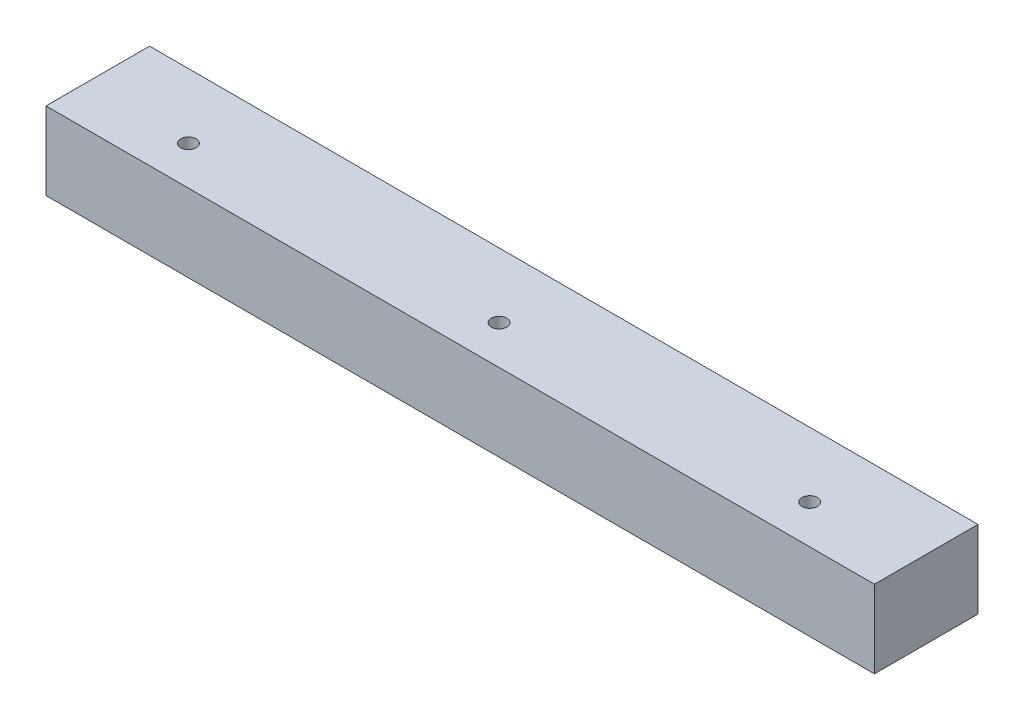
ISO-10303-21;
HEADER;
FILE_DESCRIPTION(('STEP AP214'),'2;1');
FILE_NAME('part.step','',(''),(''),'','','');
FILE_SCHEMA(('AUTOMOTIVE_DESIGN { 1 0 10303 214 1 1 1 1 }'));
ENDSEC;
DATA;
#1=APPLICATION_CONTEXT('core data for automotive mechanical design processes');
#2=APPLICATION_PROTOCOL_DEFINITION('international standard','automotive_design',2000,#1);
#3=PRODUCT_CONTEXT('',#1,'mechanical');
#4=PRODUCT('Part','Part','',(#3));
#5=PRODUCT_RELATED_PRODUCT_CATEGORY('part','',(#4));
#6=PRODUCT_DEFINITION_FORMATION('','',#4);
#7=PRODUCT_DEFINITION_CONTEXT('part definition',#1,'design');
#8=PRODUCT_DEFINITION('design','',#6,#7);
#9=PRODUCT_DEFINITION_SHAPE('','',#8);
#10=(LENGTH_UNIT() NAMED_UNIT(*) SI_UNIT(.MILLI.,.METRE.));
#11=(NAMED_UNIT(*) PLANE_ANGLE_UNIT() SI_UNIT($,.RADIAN.));
#12=(NAMED_UNIT(*) SI_UNIT($,.STERADIAN.) SOLID_ANGLE_UNIT());
#13=UNCERTAINTY_MEASURE_WITH_UNIT(LENGTH_MEASURE(1.E-05),#10,'distance_accuracy_value','');
#14=(GEOMETRIC_REPRESENTATION_CONTEXT(3) GLOBAL_UNCERTAINTY_ASSIGNED_CONTEXT((#13)) GLOBAL_UNIT_ASSIGNED_CONTEXT((#10,
#11,#12)) REPRESENTATION_CONTEXT('',''));
#15=CARTESIAN_POINT('',(0.,0.,0.));
#16=DIRECTION('',(0.,0.,1.));
#17=DIRECTION('',(1.,0.,0.));
#18=AXIS2_PLACEMENT_3D('',#15,#16,#17);
#19=CARTESIAN_POINT('',(0.,19.05,0.));
#20=DIRECTION('',(-1.,0.,0.));
#21=DIRECTION('',(0.,0.,1.));
#22=AXIS2_PLACEMENT_3D('',#19,#20,#21);
#23=PLANE('',#22);
#24=DIRECTION('',(0.,0.,-1.));
#25=VECTOR('',#24,1.);
#26=CARTESIAN_POINT('',(0.,0.,0.));
#27=LINE('',#26,#25);
#28=CARTESIAN_POINT('',(0.,0.,0.));
#29=VERTEX_POINT('',#28);
#30=CARTESIAN_POINT('',(0.,0.,-25.4));
#31=VERTEX_POINT('',#30);
#32=EDGE_CURVE('E101',#29,#31,#27,.T.);
#33=ORIENTED_EDGE('',*,*,#32,.T.);
#34=DIRECTION('',(0.,-1.,0.));
#35=VECTOR('',#34,1.);
#36=CARTESIAN_POINT('',(0.,19.05,-25.4));
#37=LINE('',#36,#35);
#38=CARTESIAN_POINT('',(0.,19.05,-25.4));
#39=VERTEX_POINT('',#38);
#40=EDGE_CURVE('E92',#39,#31,#37,.T.);
#41=ORIENTED_EDGE('',*,*,#40,.F.);
#42=DIRECTION('',(0.,0.,-1.));
#43=VECTOR('',#42,1.);
#44=CARTESIAN_POINT('',(0.,19.05,0.));
#45=LINE('',#44,#43);
#46=CARTESIAN_POINT('',(0.,19.05,0.));
#47=VERTEX_POINT('',#46);
#48=EDGE_CURVE('E86',#47,#39,#45,.T.);
#49=ORIENTED_EDGE('',*,*,#48,.F.);
#50=DIRECTION('',(0.,-1.,0.));
#51=VECTOR('',#50,1.);
#52=CARTESIAN_POINT('',(0.,19.05,0.));
#53=LINE('',#52,#51);
#54=EDGE_CURVE('E97',#47,#29,#53,.T.);
#55=ORIENTED_EDGE('',*,*,#54,.T.);
#56=EDGE_LOOP('',(#33,#41,#49,#55));
#57=FACE_BOUND('',#56,.T.);
#58=ADVANCED_FACE('F32',(#57),#23,.F.);
#59=CARTESIAN_POINT('',(0.,19.05,-25.4));
#60=DIRECTION('',(0.,0.,1.));
#61=DIRECTION('',(1.,0.,0.));
#62=AXIS2_PLACEMENT_3D('',#59,#60,#61);
#63=PLANE('',#62);
#64=DIRECTION('',(-1.,0.,0.));
#65=VECTOR('',#64,1.);
#66=CARTESIAN_POINT('',(0.,0.,-25.4));
#67=LINE('',#66,#65);
#68=CARTESIAN_POINT('',(-203.2,0.,-25.4));
#69=VERTEX_POINT('',#68);
#70=EDGE_CURVE('E91',#31,#69,#67,.T.);
#71=ORIENTED_EDGE('',*,*,#70,.T.);
#72=DIRECTION('',(0.,-1.,0.));
#73=VECTOR('',#72,1.);
#74=CARTESIAN_POINT('',(-203.2,19.05,-25.4));
#75=LINE('',#74,#73);
#76=CARTESIAN_POINT('',(-203.2,19.05,-25.4));
#77=VERTEX_POINT('',#76);
#78=EDGE_CURVE('E89',#77,#69,#75,.T.);
#79=ORIENTED_EDGE('',*,*,#78,.F.);
#80=DIRECTION('',(-1.,0.,0.));
#81=VECTOR('',#80,1.);
#82=CARTESIAN_POINT('',(0.,19.05,-25.4));
#83=LINE('',#82,#81);
#84=EDGE_CURVE('E80',#39,#77,#83,.T.);
#85=ORIENTED_EDGE('',*,*,#84,.F.);
#86=ORIENTED_EDGE('',*,*,#40,.T.);
#87=EDGE_LOOP('',(#71,#79,#85,#86));
#88=FACE_BOUND('',#87,.T.);
#89=ADVANCED_FACE('F90',(#88),#63,.F.);
#90=CARTESIAN_POINT('',(-203.2,19.05,0.));
#91=DIRECTION('',(1.,0.,0.));
#92=DIRECTION('',(0.,0.,-1.));
#93=AXIS2_PLACEMENT_3D('',#90,#91,#92);
#94=PLANE('',#93);
#95=DIRECTION('',(0.,0.,1.));
#96=VECTOR('',#95,1.);
#97=CARTESIAN_POINT('',(-203.2,0.,0.));
#98=LINE('',#97,#96);
#99=CARTESIAN_POINT('',(-203.2,0.,0.));
#100=VERTEX_POINT('',#99);
#101=EDGE_CURVE('E66',#69,#100,#98,.T.);
#102=ORIENTED_EDGE('',*,*,#101,.T.);
#103=DIRECTION('',(0.,-1.,0.));
#104=VECTOR('',#103,1.);
#105=CARTESIAN_POINT('',(-203.2,19.05,0.));
#106=LINE('',#105,#104);
#107=CARTESIAN_POINT('',(-203.2,19.05,0.));
#108=VERTEX_POINT('',#107);
#109=EDGE_CURVE('E93',#108,#100,#106,.T.);
#110=ORIENTED_EDGE('',*,*,#109,.F.);
#111=DIRECTION('',(0.,0.,1.));
#112=VECTOR('',#111,1.);
#113=CARTESIAN_POINT('',(-203.2,19.05,0.));
#114=LINE('',#113,#112);
#115=EDGE_CURVE('E84',#77,#108,#114,.T.);
#116=ORIENTED_EDGE('',*,*,#115,.F.);
#117=ORIENTED_EDGE('',*,*,#78,.T.);
#118=EDGE_LOOP('',(#102,#110,#116,#117));
#119=FACE_BOUND('',#118,.T.);
#120=ADVANCED_FACE('F95',(#119),#94,.F.);
#121=CARTESIAN_POINT('',(0.,19.05,0.));
#122=DIRECTION('',(0.,0.,-1.));
#123=DIRECTION('',(-1.,0.,0.));
#124=AXIS2_PLACEMENT_3D('',#121,#122,#123);
#125=PLANE('',#124);
#126=DIRECTION('',(1.,0.,0.));
#127=VECTOR('',#126,1.);
#128=CARTESIAN_POINT('',(0.,0.,0.));
#129=LINE('',#128,#127);
#130=EDGE_CURVE('E72',#100,#29,#129,.T.);
#131=ORIENTED_EDGE('',*,*,#130,.T.);
#132=ORIENTED_EDGE('',*,*,#54,.F.);
#133=DIRECTION('',(1.,0.,0.));
#134=VECTOR('',#133,1.);
#135=CARTESIAN_POINT('',(0.,19.05,0.));
#136=LINE('',#135,#134);
#137=EDGE_CURVE('E49',#108,#47,#136,.T.);
#138=ORIENTED_EDGE('',*,*,#137,.F.);
#139=ORIENTED_EDGE('',*,*,#109,.T.);
#140=EDGE_LOOP('',(#131,#132,#138,#139));
#141=FACE_BOUND('',#140,.T.);
#142=ADVANCED_FACE('F129',(#141),#125,.F.);
#143=CARTESIAN_POINT('',(0.,19.05,0.));
#144=DIRECTION('',(0.,1.,0.));
#145=DIRECTION('',(0.,0.,1.));
#146=AXIS2_PLACEMENT_3D('',#143,#144,#145);
#147=PLANE('',#146);
#148=CARTESIAN_POINT('',(-101.6,19.05,-9.52499999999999));
#149=DIRECTION('',(0.,-1.,0.));
#150=DIRECTION('',(0.,0.,-1.));
#151=AXIS2_PLACEMENT_3D('',#148,#149,#150);
#152=CIRCLE('',#151,1.89864999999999);
#153=CARTESIAN_POINT('',(-101.6,19.05,-11.42365));
#154=VERTEX_POINT('',#153);
#155=EDGE_CURVE('E184',#154,#154,#152,.T.);
#156=ORIENTED_EDGE('',*,*,#155,.T.);
#157=EDGE_LOOP('',(#156));
#158=FACE_BOUND('',#157,.T.);
#159=CARTESIAN_POINT('',(-25.4,19.05,-9.525));
#160=DIRECTION('',(0.,-1.,0.));
#161=DIRECTION('',(0.,0.,-1.));
#162=AXIS2_PLACEMENT_3D('',#159,#160,#161);
#163=CIRCLE('',#162,1.89864999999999);
#164=CARTESIAN_POINT('',(-25.4,19.05,-11.42365));
#165=VERTEX_POINT('',#164);
#166=EDGE_CURVE('E104',#165,#165,#163,.T.);
#167=ORIENTED_EDGE('',*,*,#166,.T.);
#168=EDGE_LOOP('',(#167));
#169=FACE_BOUND('',#168,.T.);
#170=ORIENTED_EDGE('',*,*,#48,.T.);
#171=ORIENTED_EDGE('',*,*,#84,.T.);
#172=ORIENTED_EDGE('',*,*,#115,.T.);
#173=ORIENTED_EDGE('',*,*,#137,.T.);
#174=EDGE_LOOP('',(#170,#171,#172,#173));
#175=FACE_BOUND('',#174,.T.);
#176=CARTESIAN_POINT('',(-177.8,19.05,-9.52499999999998));
#177=DIRECTION('',(0.,-1.,0.));
#178=DIRECTION('',(0.,0.,-1.));
#179=AXIS2_PLACEMENT_3D('',#176,#177,#178);
#180=CIRCLE('',#179,1.89864999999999);
#181=CARTESIAN_POINT('',(-177.8,19.05,-11.42365));
#182=VERTEX_POINT('',#181);
#183=EDGE_CURVE('E41',#182,#182,#180,.T.);
#184=ORIENTED_EDGE('',*,*,#183,.T.);
#185=EDGE_LOOP('',(#184));
#186=FACE_BOUND('',#185,.T.);
#187=ADVANCED_FACE('F81',(#158,#169,#175,#186),#147,.T.);
#188=CARTESIAN_POINT('',(0.,0.,0.));
#189=DIRECTION('',(0.,1.,0.));
#190=DIRECTION('',(0.,0.,1.));
#191=AXIS2_PLACEMENT_3D('',#188,#189,#190);
#192=PLANE('',#191);
#193=CARTESIAN_POINT('',(-101.6,0.,-9.52499999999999));
#194=DIRECTION('',(0.,-1.,0.));
#195=DIRECTION('',(0.,0.,-1.));
#196=AXIS2_PLACEMENT_3D('',#193,#194,#195);
#197=CIRCLE('',#196,1.89864999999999);
#198=CARTESIAN_POINT('',(-101.6,0.,-11.42365));
#199=VERTEX_POINT('',#198);
#200=EDGE_CURVE('E186',#199,#199,#197,.T.);
#201=ORIENTED_EDGE('',*,*,#200,.F.);
#202=EDGE_LOOP('',(#201));
#203=FACE_BOUND('',#202,.T.);
#204=CARTESIAN_POINT('',(-25.4,0.,-9.525));
#205=DIRECTION('',(0.,-1.,0.));
#206=DIRECTION('',(0.,0.,-1.));
#207=AXIS2_PLACEMENT_3D('',#204,#205,#206);
#208=CIRCLE('',#207,1.89864999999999);
#209=CARTESIAN_POINT('',(-25.4,0.,-11.42365));
#210=VERTEX_POINT('',#209);
#211=EDGE_CURVE('E187',#210,#210,#208,.T.);
#212=ORIENTED_EDGE('',*,*,#211,.F.);
#213=EDGE_LOOP('',(#212));
#214=FACE_BOUND('',#213,.T.);
#215=ORIENTED_EDGE('',*,*,#32,.F.);
#216=ORIENTED_EDGE('',*,*,#130,.F.);
#217=ORIENTED_EDGE('',*,*,#101,.F.);
#218=ORIENTED_EDGE('',*,*,#70,.F.);
#219=EDGE_LOOP('',(#215,#216,#217,#218));
#220=FACE_BOUND('',#219,.T.);
#221=CARTESIAN_POINT('',(-177.8,0.,-9.52499999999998));
#222=DIRECTION('',(0.,-1.,0.));
#223=DIRECTION('',(0.,0.,-1.));
#224=AXIS2_PLACEMENT_3D('',#221,#222,#223);
#225=CIRCLE('',#224,1.89864999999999);
#226=CARTESIAN_POINT('',(-177.8,0.,-11.42365));
#227=VERTEX_POINT('',#226);
#228=EDGE_CURVE('E11',#227,#227,#225,.T.);
#229=ORIENTED_EDGE('',*,*,#228,.F.);
#230=EDGE_LOOP('',(#229));
#231=FACE_BOUND('',#230,.T.);
#232=ADVANCED_FACE('F118',(#203,#214,#220,#231),#192,.F.);
#233=CARTESIAN_POINT('',(-25.4,0.,-9.525));
#234=DIRECTION('',(0.,-1.,0.));
#235=DIRECTION('',(0.,0.,-1.));
#236=AXIS2_PLACEMENT_3D('',#233,#234,#235);
#237=CYLINDRICAL_SURFACE('',#236,1.89864999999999);
#238=ORIENTED_EDGE('',*,*,#166,.F.);
#239=EDGE_LOOP('',(#238));
#240=FACE_BOUND('',#239,.T.);
#241=ORIENTED_EDGE('',*,*,#211,.T.);
#242=EDGE_LOOP('',(#241));
#243=FACE_BOUND('',#242,.T.);
#244=ADVANCED_FACE('F120',(#240,#243),#237,.F.);
#245=CARTESIAN_POINT('',(-101.6,0.,-9.52499999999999));
#246=DIRECTION('',(0.,-1.,0.));
#247=DIRECTION('',(0.,0.,-1.));
#248=AXIS2_PLACEMENT_3D('',#245,#246,#247);
#249=CYLINDRICAL_SURFACE('',#248,1.89864999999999);
#250=ORIENTED_EDGE('',*,*,#155,.F.);
#251=EDGE_LOOP('',(#250));
#252=FACE_BOUND('',#251,.T.);
#253=ORIENTED_EDGE('',*,*,#200,.T.);
#254=EDGE_LOOP('',(#253));
#255=FACE_BOUND('',#254,.T.);
#256=ADVANCED_FACE('F115',(#252,#255),#249,.F.);
#257=CARTESIAN_POINT('',(-177.8,0.,-9.52499999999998));
#258=DIRECTION('',(0.,-1.,0.));
#259=DIRECTION('',(0.,0.,-1.));
#260=AXIS2_PLACEMENT_3D('',#257,#258,#259);
#261=CYLINDRICAL_SURFACE('',#260,1.89864999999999);
#262=ORIENTED_EDGE('',*,*,#183,.F.);
#263=EDGE_LOOP('',(#262));
#264=FACE_BOUND('',#263,.T.);
#265=ORIENTED_EDGE('',*,*,#228,.T.);
#266=EDGE_LOOP('',(#265));
#267=FACE_BOUND('',#266,.T.);
#268=ADVANCED_FACE('F34',(#264,#267),#261,.F.);
#269=CLOSED_SHELL('',(#58,#89,#120,#142,#187,#232,#244,#256,#268));
#270=MANIFOLD_SOLID_BREP('B2',#269);
#271=ADVANCED_BREP_SHAPE_REPRESENTATION('',(#18,#270),#14);
#272=SHAPE_DEFINITION_REPRESENTATION(#9,#271);
ENDSEC;
END-ISO-10303-21;
